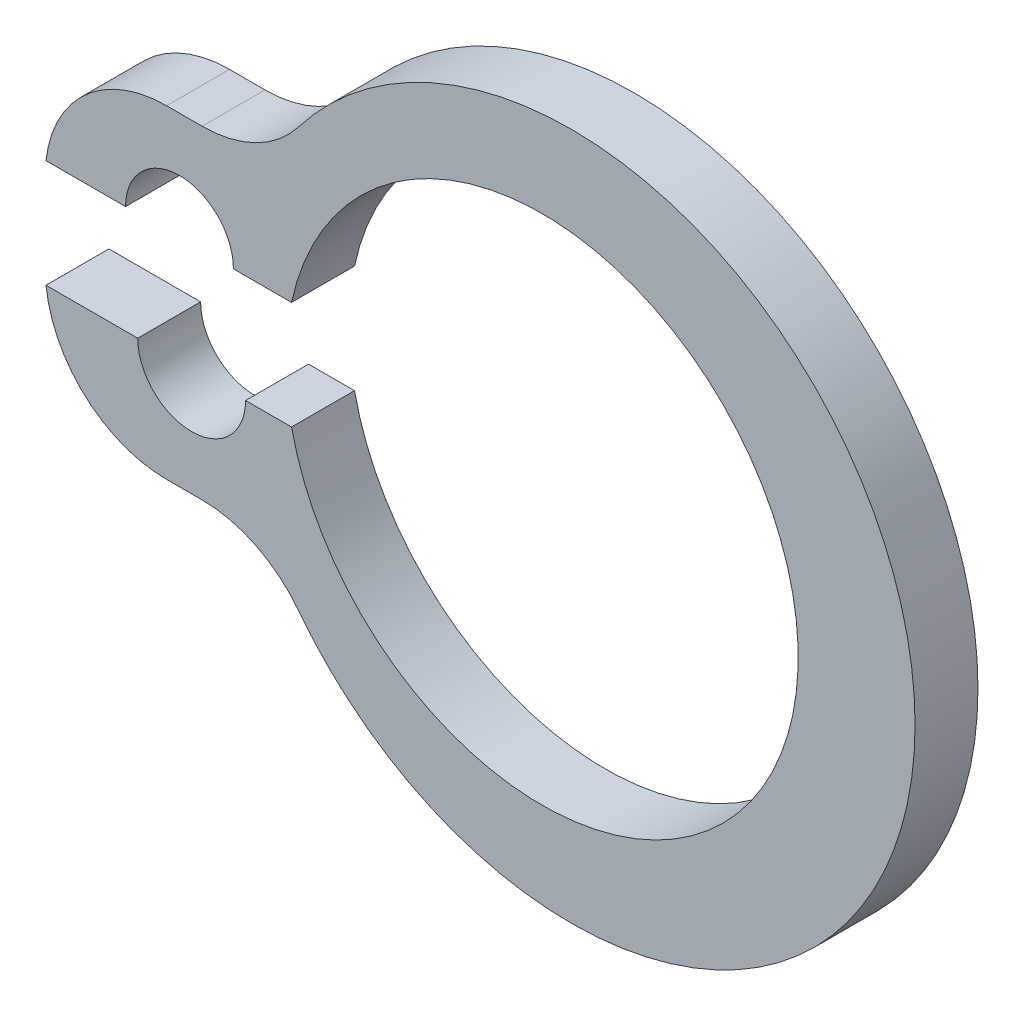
ISO-10303-21;
HEADER;
FILE_DESCRIPTION(('STEP AP214'),'2;1');
FILE_NAME('part.step','',(''),(''),'','','');
FILE_SCHEMA(('AUTOMOTIVE_DESIGN { 1 0 10303 214 1 1 1 1 }'));
ENDSEC;
DATA;
#1=APPLICATION_CONTEXT('core data for automotive mechanical design processes');
#2=APPLICATION_PROTOCOL_DEFINITION('international standard','automotive_design',2000,#1);
#3=PRODUCT_CONTEXT('',#1,'mechanical');
#4=PRODUCT('Part','Part','',(#3));
#5=PRODUCT_RELATED_PRODUCT_CATEGORY('part','',(#4));
#6=PRODUCT_DEFINITION_FORMATION('','',#4);
#7=PRODUCT_DEFINITION_CONTEXT('part definition',#1,'design');
#8=PRODUCT_DEFINITION('design','',#6,#7);
#9=PRODUCT_DEFINITION_SHAPE('','',#8);
#10=(LENGTH_UNIT() NAMED_UNIT(*) SI_UNIT(.MILLI.,.METRE.));
#11=(NAMED_UNIT(*) PLANE_ANGLE_UNIT() SI_UNIT($,.RADIAN.));
#12=(NAMED_UNIT(*) SI_UNIT($,.STERADIAN.) SOLID_ANGLE_UNIT());
#13=UNCERTAINTY_MEASURE_WITH_UNIT(LENGTH_MEASURE(1.E-05),#10,'distance_accuracy_value','');
#14=(GEOMETRIC_REPRESENTATION_CONTEXT(3) GLOBAL_UNCERTAINTY_ASSIGNED_CONTEXT((#13)) GLOBAL_UNIT_ASSIGNED_CONTEXT((#10,
#11,#12)) REPRESENTATION_CONTEXT('',''));
#15=CARTESIAN_POINT('',(0.,0.,0.));
#16=DIRECTION('',(0.,0.,1.));
#17=DIRECTION('',(1.,0.,0.));
#18=AXIS2_PLACEMENT_3D('',#15,#16,#17);
#19=CARTESIAN_POINT('',(0.,0.,0.));
#20=DIRECTION('',(0.,0.,-1.));
#21=DIRECTION('',(-1.,0.,0.));
#22=AXIS2_PLACEMENT_3D('',#19,#20,#21);
#23=PLANE('',#22);
#24=DIRECTION('',(1.,0.,0.));
#25=VECTOR('',#24,1.);
#26=CARTESIAN_POINT('',(-7.095,0.6,0.));
#27=LINE('',#26,#25);
#28=CARTESIAN_POINT('',(-2.78612634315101,0.6,0.));
#29=VERTEX_POINT('',#28);
#30=CARTESIAN_POINT('',(-3.43247224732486,0.6,0.));
#31=VERTEX_POINT('',#30);
#32=EDGE_CURVE('E155',#29,#31,#27,.F.);
#33=ORIENTED_EDGE('',*,*,#32,.T.);
#34=CARTESIAN_POINT('',(-4.03247224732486,0.6,0.));
#35=DIRECTION('',(0.,0.,1.));
#36=DIRECTION('',(1.,0.,0.));
#37=AXIS2_PLACEMENT_3D('',#34,#35,#36);
#38=CIRCLE('',#37,0.6);
#39=CARTESIAN_POINT('',(-4.63247224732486,0.6,0.));
#40=VERTEX_POINT('',#39);
#41=EDGE_CURVE('E158',#31,#40,#38,.T.);
#42=ORIENTED_EDGE('',*,*,#41,.T.);
#43=DIRECTION('',(1.,0.,0.));
#44=VECTOR('',#43,1.);
#45=CARTESIAN_POINT('',(-7.095,0.6,0.));
#46=LINE('',#45,#44);
#47=CARTESIAN_POINT('',(-5.51747224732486,0.6,0.));
#48=VERTEX_POINT('',#47);
#49=EDGE_CURVE('E159',#40,#48,#46,.F.);
#50=ORIENTED_EDGE('',*,*,#49,.T.);
#51=CARTESIAN_POINT('',(-4.17583146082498,0.45,0.));
#52=DIRECTION('',(0.,0.,1.));
#53=DIRECTION('',(1.,0.,0.));
#54=AXIS2_PLACEMENT_3D('',#51,#52,#53);
#55=CIRCLE('',#54,1.35);
#56=CARTESIAN_POINT('',(-4.17583146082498,1.8,0.));
#57=VERTEX_POINT('',#56);
#58=EDGE_CURVE('E162',#57,#48,#55,.T.);
#59=ORIENTED_EDGE('',*,*,#58,.F.);
#60=DIRECTION('',(1.,0.,0.));
#61=VECTOR('',#60,1.);
#62=CARTESIAN_POINT('',(0.,1.8,0.));
#63=LINE('',#62,#61);
#64=CARTESIAN_POINT('',(-3.7808647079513,1.8,0.));
#65=VERTEX_POINT('',#64);
#66=EDGE_CURVE('E166',#65,#57,#63,.F.);
#67=ORIENTED_EDGE('',*,*,#66,.F.);
#68=CARTESIAN_POINT('',(-3.7808647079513,3.15,0.));
#69=DIRECTION('',(0.,0.,1.));
#70=DIRECTION('',(1.,0.,0.));
#71=AXIS2_PLACEMENT_3D('',#68,#69,#70);
#72=CIRCLE('',#71,1.35);
#73=CARTESIAN_POINT('',(-2.70976956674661,2.32826086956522,0.));
#74=VERTEX_POINT('',#73);
#75=EDGE_CURVE('E125',#65,#74,#72,.T.);
#76=ORIENTED_EDGE('',*,*,#75,.T.);
#77=CARTESIAN_POINT('',(0.325,0.,0.));
#78=DIRECTION('',(0.,0.,1.));
#79=DIRECTION('',(1.,0.,0.));
#80=AXIS2_PLACEMENT_3D('',#77,#78,#79);
#81=CIRCLE('',#80,3.825);
#82=CARTESIAN_POINT('',(-2.70976956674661,-2.32826086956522,0.));
#83=VERTEX_POINT('',#82);
#84=EDGE_CURVE('E123',#83,#74,#81,.T.);
#85=ORIENTED_EDGE('',*,*,#84,.F.);
#86=CARTESIAN_POINT('',(-3.7808647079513,-3.15,0.));
#87=DIRECTION('',(0.,0.,1.));
#88=DIRECTION('',(1.,0.,0.));
#89=AXIS2_PLACEMENT_3D('',#86,#87,#88);
#90=CIRCLE('',#89,1.35);
#91=CARTESIAN_POINT('',(-3.7808647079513,-1.8,0.));
#92=VERTEX_POINT('',#91);
#93=EDGE_CURVE('E20',#83,#92,#90,.T.);
#94=ORIENTED_EDGE('',*,*,#93,.T.);
#95=DIRECTION('',(-1.,0.,0.));
#96=VECTOR('',#95,1.);
#97=CARTESIAN_POINT('',(0.,-1.8,0.));
#98=LINE('',#97,#96);
#99=CARTESIAN_POINT('',(-4.17583146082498,-1.8,0.));
#100=VERTEX_POINT('',#99);
#101=EDGE_CURVE('E121',#92,#100,#98,.T.);
#102=ORIENTED_EDGE('',*,*,#101,.T.);
#103=CARTESIAN_POINT('',(-4.17583146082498,-0.45,0.));
#104=DIRECTION('',(0.,0.,1.));
#105=DIRECTION('',(1.,0.,0.));
#106=AXIS2_PLACEMENT_3D('',#103,#104,#105);
#107=CIRCLE('',#106,1.35);
#108=CARTESIAN_POINT('',(-5.51747224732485,-0.599999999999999,0.));
#109=VERTEX_POINT('',#108);
#110=EDGE_CURVE('E134',#109,#100,#107,.T.);
#111=ORIENTED_EDGE('',*,*,#110,.F.);
#112=DIRECTION('',(1.,0.,0.));
#113=VECTOR('',#112,1.);
#114=CARTESIAN_POINT('',(-7.095,-0.6,0.));
#115=LINE('',#114,#113);
#116=CARTESIAN_POINT('',(-4.49747224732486,-0.6,0.));
#117=VERTEX_POINT('',#116);
#118=EDGE_CURVE('E143',#109,#117,#115,.T.);
#119=ORIENTED_EDGE('',*,*,#118,.T.);
#120=CARTESIAN_POINT('',(-3.89747224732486,-0.6,0.));
#121=DIRECTION('',(0.,0.,1.));
#122=DIRECTION('',(1.,0.,0.));
#123=AXIS2_PLACEMENT_3D('',#120,#121,#122);
#124=CIRCLE('',#123,0.6);
#125=CARTESIAN_POINT('',(-3.29747224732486,-0.6,0.));
#126=VERTEX_POINT('',#125);
#127=EDGE_CURVE('E146',#117,#126,#124,.T.);
#128=ORIENTED_EDGE('',*,*,#127,.T.);
#129=DIRECTION('',(1.,0.,0.));
#130=VECTOR('',#129,1.);
#131=CARTESIAN_POINT('',(-7.095,-0.6,0.));
#132=LINE('',#131,#130);
#133=CARTESIAN_POINT('',(-2.78612634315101,-0.6,0.));
#134=VERTEX_POINT('',#133);
#135=EDGE_CURVE('E147',#126,#134,#132,.T.);
#136=ORIENTED_EDGE('',*,*,#135,.T.);
#137=CARTESIAN_POINT('',(0.,0.,0.));
#138=DIRECTION('',(0.,0.,1.));
#139=DIRECTION('',(1.,0.,0.));
#140=AXIS2_PLACEMENT_3D('',#137,#138,#139);
#141=CIRCLE('',#140,2.85);
#142=EDGE_CURVE('E152',#134,#29,#141,.T.);
#143=ORIENTED_EDGE('',*,*,#142,.T.);
#144=EDGE_LOOP('',(#33,#42,#50,#59,#67,#76,#85,#94,#102,#111,#119,#128,#136,#143));
#145=FACE_BOUND('',#144,.T.);
#146=ADVANCED_FACE('F17',(#145),#23,.T.);
#147=CARTESIAN_POINT('',(0.325,0.,0.));
#148=DIRECTION('',(0.,0.,1.));
#149=DIRECTION('',(1.,0.,0.));
#150=AXIS2_PLACEMENT_3D('',#147,#148,#149);
#151=CYLINDRICAL_SURFACE('',#150,3.825);
#152=CARTESIAN_POINT('',(0.325,0.,0.7));
#153=DIRECTION('',(0.,0.,1.));
#154=DIRECTION('',(1.,0.,0.));
#155=AXIS2_PLACEMENT_3D('',#152,#153,#154);
#156=CIRCLE('',#155,3.825);
#157=CARTESIAN_POINT('',(-2.70976956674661,-2.32826086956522,0.7));
#158=VERTEX_POINT('',#157);
#159=CARTESIAN_POINT('',(-2.70976956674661,2.32826086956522,0.7));
#160=VERTEX_POINT('',#159);
#161=EDGE_CURVE('E130',#158,#160,#156,.T.);
#162=ORIENTED_EDGE('',*,*,#161,.F.);
#163=DIRECTION('',(0.,0.,1.));
#164=VECTOR('',#163,1.);
#165=CARTESIAN_POINT('',(-2.70976956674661,-2.32826086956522,0.));
#166=LINE('',#165,#164);
#167=EDGE_CURVE('E119',#158,#83,#166,.F.);
#168=ORIENTED_EDGE('',*,*,#167,.T.);
#169=ORIENTED_EDGE('',*,*,#84,.T.);
#170=DIRECTION('',(0.,0.,1.));
#171=VECTOR('',#170,1.);
#172=CARTESIAN_POINT('',(-2.70976956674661,2.32826086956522,0.));
#173=LINE('',#172,#171);
#174=EDGE_CURVE('E170',#74,#160,#173,.T.);
#175=ORIENTED_EDGE('',*,*,#174,.T.);
#176=EDGE_LOOP('',(#162,#168,#169,#175));
#177=FACE_BOUND('',#176,.T.);
#178=ADVANCED_FACE('F128',(#177),#151,.T.);
#179=CARTESIAN_POINT('',(-3.7808647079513,3.15,0.));
#180=DIRECTION('',(0.,0.,1.));
#181=DIRECTION('',(1.,0.,0.));
#182=AXIS2_PLACEMENT_3D('',#179,#180,#181);
#183=CYLINDRICAL_SURFACE('',#182,1.35);
#184=ORIENTED_EDGE('',*,*,#174,.F.);
#185=ORIENTED_EDGE('',*,*,#75,.F.);
#186=DIRECTION('',(0.,0.,1.));
#187=VECTOR('',#186,1.);
#188=CARTESIAN_POINT('',(-3.7808647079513,1.8,0.));
#189=LINE('',#188,#187);
#190=CARTESIAN_POINT('',(-3.7808647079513,1.8,0.7));
#191=VERTEX_POINT('',#190);
#192=EDGE_CURVE('E167',#191,#65,#189,.F.);
#193=ORIENTED_EDGE('',*,*,#192,.F.);
#194=CARTESIAN_POINT('',(-3.7808647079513,3.15,0.7));
#195=DIRECTION('',(0.,0.,1.));
#196=DIRECTION('',(1.,0.,0.));
#197=AXIS2_PLACEMENT_3D('',#194,#195,#196);
#198=CIRCLE('',#197,1.35);
#199=EDGE_CURVE('E200',#160,#191,#198,.F.);
#200=ORIENTED_EDGE('',*,*,#199,.F.);
#201=EDGE_LOOP('',(#184,#185,#193,#200));
#202=FACE_BOUND('',#201,.T.);
#203=ADVANCED_FACE('F353',(#202),#183,.F.);
#204=CARTESIAN_POINT('',(0.,1.8,0.));
#205=DIRECTION('',(0.,1.,0.));
#206=DIRECTION('',(0.,0.,1.));
#207=AXIS2_PLACEMENT_3D('',#204,#205,#206);
#208=PLANE('',#207);
#209=ORIENTED_EDGE('',*,*,#66,.T.);
#210=DIRECTION('',(0.,0.,1.));
#211=VECTOR('',#210,1.);
#212=CARTESIAN_POINT('',(-4.17583146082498,1.8,0.));
#213=LINE('',#212,#211);
#214=CARTESIAN_POINT('',(-4.17583146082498,1.8,0.7));
#215=VERTEX_POINT('',#214);
#216=EDGE_CURVE('E163',#215,#57,#213,.F.);
#217=ORIENTED_EDGE('',*,*,#216,.F.);
#218=DIRECTION('',(1.,0.,0.));
#219=VECTOR('',#218,1.);
#220=CARTESIAN_POINT('',(0.,1.8,0.7));
#221=LINE('',#220,#219);
#222=EDGE_CURVE('E199',#191,#215,#221,.F.);
#223=ORIENTED_EDGE('',*,*,#222,.F.);
#224=ORIENTED_EDGE('',*,*,#192,.T.);
#225=EDGE_LOOP('',(#209,#217,#223,#224));
#226=FACE_BOUND('',#225,.T.);
#227=ADVANCED_FACE('F346',(#226),#208,.T.);
#228=CARTESIAN_POINT('',(-4.17583146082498,0.45,0.));
#229=DIRECTION('',(0.,0.,1.));
#230=DIRECTION('',(1.,0.,0.));
#231=AXIS2_PLACEMENT_3D('',#228,#229,#230);
#232=CYLINDRICAL_SURFACE('',#231,1.35);
#233=ORIENTED_EDGE('',*,*,#58,.T.);
#234=DIRECTION('',(0.,0.,1.));
#235=VECTOR('',#234,1.);
#236=CARTESIAN_POINT('',(-5.51747224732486,0.6,0.7));
#237=LINE('',#236,#235);
#238=CARTESIAN_POINT('',(-5.51747224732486,0.6,0.7));
#239=VERTEX_POINT('',#238);
#240=EDGE_CURVE('E160',#48,#239,#237,.T.);
#241=ORIENTED_EDGE('',*,*,#240,.T.);
#242=CARTESIAN_POINT('',(-4.17583146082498,0.45,0.7));
#243=DIRECTION('',(0.,0.,1.));
#244=DIRECTION('',(1.,0.,0.));
#245=AXIS2_PLACEMENT_3D('',#242,#243,#244);
#246=CIRCLE('',#245,1.35);
#247=EDGE_CURVE('E196',#215,#239,#246,.T.);
#248=ORIENTED_EDGE('',*,*,#247,.F.);
#249=ORIENTED_EDGE('',*,*,#216,.T.);
#250=EDGE_LOOP('',(#233,#241,#248,#249));
#251=FACE_BOUND('',#250,.T.);
#252=ADVANCED_FACE('F214',(#251),#232,.T.);
#253=CARTESIAN_POINT('',(-7.095,0.6,0.7));
#254=DIRECTION('',(0.,1.,0.));
#255=DIRECTION('',(0.,0.,1.));
#256=AXIS2_PLACEMENT_3D('',#253,#254,#255);
#257=PLANE('',#256);
#258=DIRECTION('',(0.,0.,1.));
#259=VECTOR('',#258,1.);
#260=CARTESIAN_POINT('',(-4.63247224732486,0.6,0.));
#261=LINE('',#260,#259);
#262=CARTESIAN_POINT('',(-4.63247224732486,0.6,0.7));
#263=VERTEX_POINT('',#262);
#264=EDGE_CURVE('E156',#40,#263,#261,.T.);
#265=ORIENTED_EDGE('',*,*,#264,.T.);
#266=DIRECTION('',(1.,0.,0.));
#267=VECTOR('',#266,1.);
#268=CARTESIAN_POINT('',(0.,0.6,0.7));
#269=LINE('',#268,#267);
#270=EDGE_CURVE('E195',#239,#263,#269,.T.);
#271=ORIENTED_EDGE('',*,*,#270,.F.);
#272=ORIENTED_EDGE('',*,*,#240,.F.);
#273=ORIENTED_EDGE('',*,*,#49,.F.);
#274=EDGE_LOOP('',(#265,#271,#272,#273));
#275=FACE_BOUND('',#274,.T.);
#276=ADVANCED_FACE('F221',(#275),#257,.F.);
#277=CARTESIAN_POINT('',(-4.03247224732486,0.6,0.));
#278=DIRECTION('',(0.,0.,1.));
#279=DIRECTION('',(1.,0.,0.));
#280=AXIS2_PLACEMENT_3D('',#277,#278,#279);
#281=CYLINDRICAL_SURFACE('',#280,0.6);
#282=DIRECTION('',(0.,0.,1.));
#283=VECTOR('',#282,1.);
#284=CARTESIAN_POINT('',(-3.43247224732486,0.6,0.7));
#285=LINE('',#284,#283);
#286=CARTESIAN_POINT('',(-3.43247224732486,0.6,0.7));
#287=VERTEX_POINT('',#286);
#288=EDGE_CURVE('E153',#31,#287,#285,.T.);
#289=ORIENTED_EDGE('',*,*,#288,.T.);
#290=CARTESIAN_POINT('',(-4.03247224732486,0.6,0.7));
#291=DIRECTION('',(0.,0.,1.));
#292=DIRECTION('',(1.,0.,0.));
#293=AXIS2_PLACEMENT_3D('',#290,#291,#292);
#294=CIRCLE('',#293,0.6);
#295=EDGE_CURVE('E192',#263,#287,#294,.F.);
#296=ORIENTED_EDGE('',*,*,#295,.F.);
#297=ORIENTED_EDGE('',*,*,#264,.F.);
#298=ORIENTED_EDGE('',*,*,#41,.F.);
#299=EDGE_LOOP('',(#289,#296,#297,#298));
#300=FACE_BOUND('',#299,.T.);
#301=ADVANCED_FACE('F268',(#300),#281,.F.);
#302=CARTESIAN_POINT('',(-7.095,0.6,0.7));
#303=DIRECTION('',(0.,1.,0.));
#304=DIRECTION('',(0.,0.,1.));
#305=AXIS2_PLACEMENT_3D('',#302,#303,#304);
#306=PLANE('',#305);
#307=ORIENTED_EDGE('',*,*,#288,.F.);
#308=ORIENTED_EDGE('',*,*,#32,.F.);
#309=DIRECTION('',(0.,0.,1.));
#310=VECTOR('',#309,1.);
#311=CARTESIAN_POINT('',(-2.78612634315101,0.6,0.));
#312=LINE('',#311,#310);
#313=CARTESIAN_POINT('',(-2.78612634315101,0.6,0.7));
#314=VERTEX_POINT('',#313);
#315=EDGE_CURVE('E150',#29,#314,#312,.T.);
#316=ORIENTED_EDGE('',*,*,#315,.T.);
#317=DIRECTION('',(1.,0.,0.));
#318=VECTOR('',#317,1.);
#319=CARTESIAN_POINT('',(0.,0.6,0.7));
#320=LINE('',#319,#318);
#321=EDGE_CURVE('E191',#287,#314,#320,.T.);
#322=ORIENTED_EDGE('',*,*,#321,.F.);
#323=EDGE_LOOP('',(#307,#308,#316,#322));
#324=FACE_BOUND('',#323,.T.);
#325=ADVANCED_FACE('F264',(#324),#306,.F.);
#326=CARTESIAN_POINT('',(0.,0.,0.));
#327=DIRECTION('',(0.,0.,1.));
#328=DIRECTION('',(1.,0.,0.));
#329=AXIS2_PLACEMENT_3D('',#326,#327,#328);
#330=CYLINDRICAL_SURFACE('',#329,2.85);
#331=ORIENTED_EDGE('',*,*,#315,.F.);
#332=ORIENTED_EDGE('',*,*,#142,.F.);
#333=DIRECTION('',(0.,0.,-1.));
#334=VECTOR('',#333,1.);
#335=CARTESIAN_POINT('',(-2.78612634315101,-0.6,0.7));
#336=LINE('',#335,#334);
#337=CARTESIAN_POINT('',(-2.78612634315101,-0.6,0.7));
#338=VERTEX_POINT('',#337);
#339=EDGE_CURVE('E148',#134,#338,#336,.F.);
#340=ORIENTED_EDGE('',*,*,#339,.T.);
#341=CARTESIAN_POINT('',(0.,0.,0.7));
#342=DIRECTION('',(0.,0.,1.));
#343=DIRECTION('',(1.,0.,0.));
#344=AXIS2_PLACEMENT_3D('',#341,#342,#343);
#345=CIRCLE('',#344,2.85);
#346=EDGE_CURVE('E188',#314,#338,#345,.F.);
#347=ORIENTED_EDGE('',*,*,#346,.F.);
#348=EDGE_LOOP('',(#331,#332,#340,#347));
#349=FACE_BOUND('',#348,.T.);
#350=ADVANCED_FACE('F266',(#349),#330,.F.);
#351=CARTESIAN_POINT('',(-7.095,-0.6,0.7));
#352=DIRECTION('',(0.,-1.,0.));
#353=DIRECTION('',(0.,0.,-1.));
#354=AXIS2_PLACEMENT_3D('',#351,#352,#353);
#355=PLANE('',#354);
#356=DIRECTION('',(0.,0.,1.));
#357=VECTOR('',#356,1.);
#358=CARTESIAN_POINT('',(-3.29747224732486,-0.6,0.));
#359=LINE('',#358,#357);
#360=CARTESIAN_POINT('',(-3.29747224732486,-0.6,0.7));
#361=VERTEX_POINT('',#360);
#362=EDGE_CURVE('E144',#126,#361,#359,.T.);
#363=ORIENTED_EDGE('',*,*,#362,.T.);
#364=DIRECTION('',(1.,0.,0.));
#365=VECTOR('',#364,1.);
#366=CARTESIAN_POINT('',(0.,-0.6,0.7));
#367=LINE('',#366,#365);
#368=EDGE_CURVE('E187',#338,#361,#367,.F.);
#369=ORIENTED_EDGE('',*,*,#368,.F.);
#370=ORIENTED_EDGE('',*,*,#339,.F.);
#371=ORIENTED_EDGE('',*,*,#135,.F.);
#372=EDGE_LOOP('',(#363,#369,#370,#371));
#373=FACE_BOUND('',#372,.T.);
#374=ADVANCED_FACE('F258',(#373),#355,.F.);
#375=CARTESIAN_POINT('',(-3.89747224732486,-0.6,0.));
#376=DIRECTION('',(0.,0.,1.));
#377=DIRECTION('',(1.,0.,0.));
#378=AXIS2_PLACEMENT_3D('',#375,#376,#377);
#379=CYLINDRICAL_SURFACE('',#378,0.6);
#380=DIRECTION('',(0.,0.,-1.));
#381=VECTOR('',#380,1.);
#382=CARTESIAN_POINT('',(-4.49747224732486,-0.6,0.7));
#383=LINE('',#382,#381);
#384=CARTESIAN_POINT('',(-4.49747224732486,-0.6,0.7));
#385=VERTEX_POINT('',#384);
#386=EDGE_CURVE('E141',#117,#385,#383,.F.);
#387=ORIENTED_EDGE('',*,*,#386,.T.);
#388=CARTESIAN_POINT('',(-3.89747224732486,-0.6,0.7));
#389=DIRECTION('',(0.,0.,1.));
#390=DIRECTION('',(1.,0.,0.));
#391=AXIS2_PLACEMENT_3D('',#388,#389,#390);
#392=CIRCLE('',#391,0.6);
#393=EDGE_CURVE('E184',#361,#385,#392,.F.);
#394=ORIENTED_EDGE('',*,*,#393,.F.);
#395=ORIENTED_EDGE('',*,*,#362,.F.);
#396=ORIENTED_EDGE('',*,*,#127,.F.);
#397=EDGE_LOOP('',(#387,#394,#395,#396));
#398=FACE_BOUND('',#397,.T.);
#399=ADVANCED_FACE('F250',(#398),#379,.F.);
#400=CARTESIAN_POINT('',(-7.095,-0.6,0.7));
#401=DIRECTION('',(0.,-1.,0.));
#402=DIRECTION('',(0.,0.,-1.));
#403=AXIS2_PLACEMENT_3D('',#400,#401,#402);
#404=PLANE('',#403);
#405=ORIENTED_EDGE('',*,*,#386,.F.);
#406=ORIENTED_EDGE('',*,*,#118,.F.);
#407=DIRECTION('',(0.,0.,1.));
#408=VECTOR('',#407,1.);
#409=CARTESIAN_POINT('',(-5.51747224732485,-0.599999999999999,0.));
#410=LINE('',#409,#408);
#411=CARTESIAN_POINT('',(-5.51747224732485,-0.599999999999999,0.7));
#412=VERTEX_POINT('',#411);
#413=EDGE_CURVE('E138',#412,#109,#410,.F.);
#414=ORIENTED_EDGE('',*,*,#413,.F.);
#415=DIRECTION('',(1.,0.,0.));
#416=VECTOR('',#415,1.);
#417=CARTESIAN_POINT('',(0.,-0.6,0.7));
#418=LINE('',#417,#416);
#419=EDGE_CURVE('E183',#385,#412,#418,.F.);
#420=ORIENTED_EDGE('',*,*,#419,.F.);
#421=EDGE_LOOP('',(#405,#406,#414,#420));
#422=FACE_BOUND('',#421,.T.);
#423=ADVANCED_FACE('F253',(#422),#404,.F.);
#424=CARTESIAN_POINT('',(-4.17583146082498,-0.45,0.));
#425=DIRECTION('',(0.,0.,1.));
#426=DIRECTION('',(1.,0.,0.));
#427=AXIS2_PLACEMENT_3D('',#424,#425,#426);
#428=CYLINDRICAL_SURFACE('',#427,1.35);
#429=ORIENTED_EDGE('',*,*,#110,.T.);
#430=DIRECTION('',(0.,0.,1.));
#431=VECTOR('',#430,1.);
#432=CARTESIAN_POINT('',(-4.17583146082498,-1.8,0.));
#433=LINE('',#432,#431);
#434=CARTESIAN_POINT('',(-4.17583146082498,-1.8,0.7));
#435=VERTEX_POINT('',#434);
#436=EDGE_CURVE('E131',#100,#435,#433,.T.);
#437=ORIENTED_EDGE('',*,*,#436,.T.);
#438=CARTESIAN_POINT('',(-4.17583146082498,-0.45,0.7));
#439=DIRECTION('',(0.,0.,1.));
#440=DIRECTION('',(1.,0.,0.));
#441=AXIS2_PLACEMENT_3D('',#438,#439,#440);
#442=CIRCLE('',#441,1.35);
#443=EDGE_CURVE('E180',#412,#435,#442,.T.);
#444=ORIENTED_EDGE('',*,*,#443,.F.);
#445=ORIENTED_EDGE('',*,*,#413,.T.);
#446=EDGE_LOOP('',(#429,#437,#444,#445));
#447=FACE_BOUND('',#446,.T.);
#448=ADVANCED_FACE('F243',(#447),#428,.T.);
#449=CARTESIAN_POINT('',(0.,-1.8,0.));
#450=DIRECTION('',(0.,1.,0.));
#451=DIRECTION('',(0.,0.,1.));
#452=AXIS2_PLACEMENT_3D('',#449,#450,#451);
#453=PLANE('',#452);
#454=DIRECTION('',(0.,0.,1.));
#455=VECTOR('',#454,1.);
#456=CARTESIAN_POINT('',(-3.7808647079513,-1.8,0.));
#457=LINE('',#456,#455);
#458=CARTESIAN_POINT('',(-3.7808647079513,-1.8,0.7));
#459=VERTEX_POINT('',#458);
#460=EDGE_CURVE('E35',#92,#459,#457,.T.);
#461=ORIENTED_EDGE('',*,*,#460,.T.);
#462=DIRECTION('',(1.,0.,0.));
#463=VECTOR('',#462,1.);
#464=CARTESIAN_POINT('',(0.,-1.8,0.7));
#465=LINE('',#464,#463);
#466=EDGE_CURVE('E26',#435,#459,#465,.T.);
#467=ORIENTED_EDGE('',*,*,#466,.F.);
#468=ORIENTED_EDGE('',*,*,#436,.F.);
#469=ORIENTED_EDGE('',*,*,#101,.F.);
#470=EDGE_LOOP('',(#461,#467,#468,#469));
#471=FACE_BOUND('',#470,.T.);
#472=ADVANCED_FACE('F241',(#471),#453,.F.);
#473=CARTESIAN_POINT('',(-3.7808647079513,-3.15,0.));
#474=DIRECTION('',(0.,0.,1.));
#475=DIRECTION('',(1.,0.,0.));
#476=AXIS2_PLACEMENT_3D('',#473,#474,#475);
#477=CYLINDRICAL_SURFACE('',#476,1.35);
#478=ORIENTED_EDGE('',*,*,#460,.F.);
#479=ORIENTED_EDGE('',*,*,#93,.F.);
#480=ORIENTED_EDGE('',*,*,#167,.F.);
#481=CARTESIAN_POINT('',(-3.7808647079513,-3.15,0.7));
#482=DIRECTION('',(0.,0.,1.));
#483=DIRECTION('',(1.,0.,0.));
#484=AXIS2_PLACEMENT_3D('',#481,#482,#483);
#485=CIRCLE('',#484,1.35);
#486=EDGE_CURVE('E11',#459,#158,#485,.F.);
#487=ORIENTED_EDGE('',*,*,#486,.F.);
#488=EDGE_LOOP('',(#478,#479,#480,#487));
#489=FACE_BOUND('',#488,.T.);
#490=ADVANCED_FACE('F117',(#489),#477,.F.);
#491=CARTESIAN_POINT('',(0.,0.,0.7));
#492=DIRECTION('',(0.,0.,1.));
#493=DIRECTION('',(1.,0.,0.));
#494=AXIS2_PLACEMENT_3D('',#491,#492,#493);
#495=PLANE('',#494);
#496=ORIENTED_EDGE('',*,*,#466,.T.);
#497=ORIENTED_EDGE('',*,*,#486,.T.);
#498=ORIENTED_EDGE('',*,*,#161,.T.);
#499=ORIENTED_EDGE('',*,*,#199,.T.);
#500=ORIENTED_EDGE('',*,*,#222,.T.);
#501=ORIENTED_EDGE('',*,*,#247,.T.);
#502=ORIENTED_EDGE('',*,*,#270,.T.);
#503=ORIENTED_EDGE('',*,*,#295,.T.);
#504=ORIENTED_EDGE('',*,*,#321,.T.);
#505=ORIENTED_EDGE('',*,*,#346,.T.);
#506=ORIENTED_EDGE('',*,*,#368,.T.);
#507=ORIENTED_EDGE('',*,*,#393,.T.);
#508=ORIENTED_EDGE('',*,*,#419,.T.);
#509=ORIENTED_EDGE('',*,*,#443,.T.);
#510=EDGE_LOOP('',(#496,#497,#498,#499,#500,#501,#502,#503,#504,#505,#506,#507,#508,#509));
#511=FACE_BOUND('',#510,.T.);
#512=ADVANCED_FACE('F228',(#511),#495,.T.);
#513=CLOSED_SHELL('',(#146,#178,#203,#227,#252,#276,#301,#325,#350,#374,#399,#423,#448,#472,
#490,#512));
#514=MANIFOLD_SOLID_BREP('B1',#513);
#515=ADVANCED_BREP_SHAPE_REPRESENTATION('',(#18,#514),#14);
#516=SHAPE_DEFINITION_REPRESENTATION(#9,#515);
ENDSEC;
END-ISO-10303-21;
